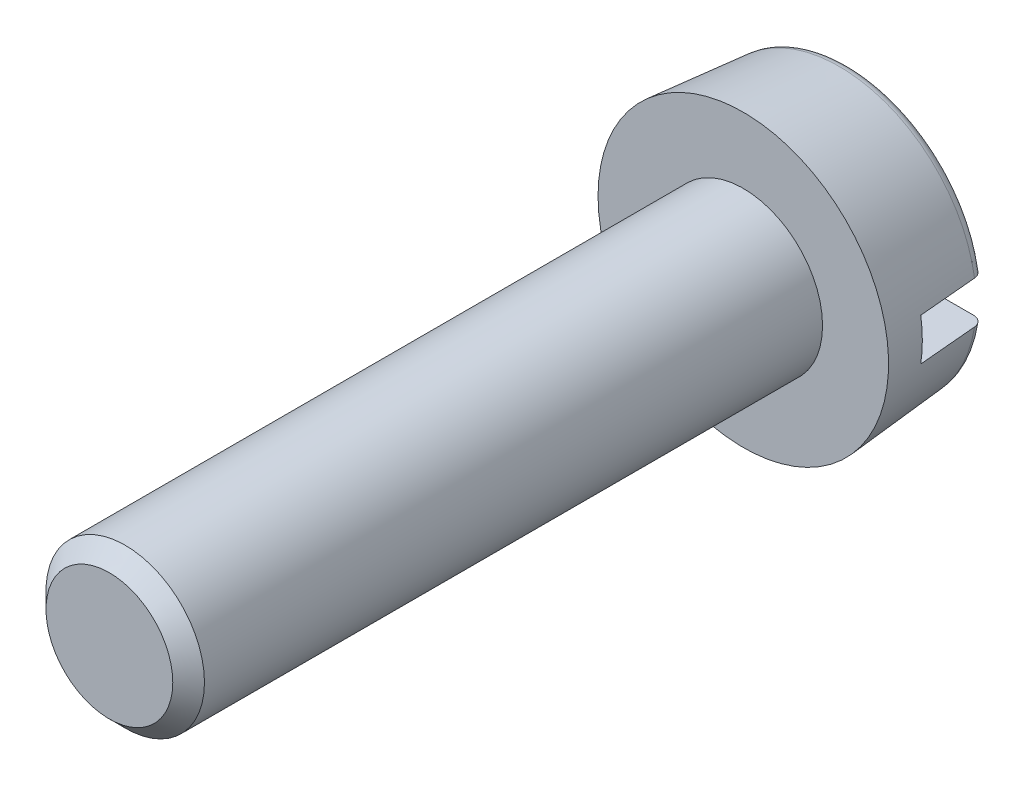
ISO-10303-21;
HEADER;
FILE_DESCRIPTION(('STEP AP214'),'2;1');
FILE_NAME('part.step','',(''),(''),'','','');
FILE_SCHEMA(('AUTOMOTIVE_DESIGN { 1 0 10303 214 1 1 1 1 }'));
ENDSEC;
DATA;
#1=APPLICATION_CONTEXT('core data for automotive mechanical design processes');
#2=APPLICATION_PROTOCOL_DEFINITION('international standard','automotive_design',2000,#1);
#3=PRODUCT_CONTEXT('',#1,'mechanical');
#4=PRODUCT('Part','Part','',(#3));
#5=PRODUCT_RELATED_PRODUCT_CATEGORY('part','',(#4));
#6=PRODUCT_DEFINITION_FORMATION('','',#4);
#7=PRODUCT_DEFINITION_CONTEXT('part definition',#1,'design');
#8=PRODUCT_DEFINITION('design','',#6,#7);
#9=PRODUCT_DEFINITION_SHAPE('','',#8);
#10=(LENGTH_UNIT() NAMED_UNIT(*) SI_UNIT(.MILLI.,.METRE.));
#11=(NAMED_UNIT(*) PLANE_ANGLE_UNIT() SI_UNIT($,.RADIAN.));
#12=(NAMED_UNIT(*) SI_UNIT($,.STERADIAN.) SOLID_ANGLE_UNIT());
#13=UNCERTAINTY_MEASURE_WITH_UNIT(LENGTH_MEASURE(1.E-05),#10,'distance_accuracy_value','');
#14=(GEOMETRIC_REPRESENTATION_CONTEXT(3) GLOBAL_UNCERTAINTY_ASSIGNED_CONTEXT((#13)) GLOBAL_UNIT_ASSIGNED_CONTEXT((#10,
#11,#12)) REPRESENTATION_CONTEXT('',''));
#15=CARTESIAN_POINT('',(0.,0.,0.));
#16=DIRECTION('',(0.,0.,1.));
#17=DIRECTION('',(1.,0.,0.));
#18=AXIS2_PLACEMENT_3D('',#15,#16,#17);
#19=CARTESIAN_POINT('',(0.,0.,-2.));
#20=DIRECTION('',(0.,0.,1.));
#21=DIRECTION('',(1.,0.,0.));
#22=AXIS2_PLACEMENT_3D('',#19,#20,#21);
#23=PLANE('',#22);
#24=DIRECTION('',(1.,0.,0.));
#25=VECTOR('',#24,1.);
#26=CARTESIAN_POINT('',(-2.75,-0.4,-2.));
#27=LINE('',#26,#25);
#28=CARTESIAN_POINT('',(-2.35807100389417,-0.4,-2.));
#29=VERTEX_POINT('',#28);
#30=CARTESIAN_POINT('',(2.35807100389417,-0.4,-2.));
#31=VERTEX_POINT('',#30);
#32=EDGE_CURVE('E196',#29,#31,#27,.T.);
#33=ORIENTED_EDGE('',*,*,#32,.T.);
#34=CARTESIAN_POINT('',(0.,0.,-2.));
#35=DIRECTION('',(0.,0.,-1.));
#36=DIRECTION('',(-1.,0.,0.));
#37=AXIS2_PLACEMENT_3D('',#34,#35,#36);
#38=CIRCLE('',#37,2.39175643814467);
#39=EDGE_CURVE('E106',#31,#29,#38,.T.);
#40=ORIENTED_EDGE('',*,*,#39,.T.);
#41=EDGE_LOOP('',(#33,#40));
#42=FACE_BOUND('',#41,.T.);
#43=ADVANCED_FACE('F26',(#42),#23,.F.);
#44=DIRECTION('',(-1.,0.,0.));
#45=VECTOR('',#44,1.);
#46=CARTESIAN_POINT('',(-2.75,0.4,-2.));
#47=LINE('',#46,#45);
#48=CARTESIAN_POINT('',(2.35807100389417,0.4,-2.));
#49=VERTEX_POINT('',#48);
#50=CARTESIAN_POINT('',(-2.35807100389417,0.4,-2.));
#51=VERTEX_POINT('',#50);
#52=EDGE_CURVE('E91',#49,#51,#47,.T.);
#53=ORIENTED_EDGE('',*,*,#52,.T.);
#54=EDGE_CURVE('E103',#51,#49,#38,.T.);
#55=ORIENTED_EDGE('',*,*,#54,.T.);
#56=EDGE_LOOP('',(#53,#55));
#57=FACE_BOUND('',#56,.T.);
#58=ADVANCED_FACE('F137',(#57),#23,.F.);
#59=CARTESIAN_POINT('',(0.,0.,-1.8));
#60=DIRECTION('',(0.,0.,-1.));
#61=DIRECTION('',(-1.,0.,0.));
#62=AXIS2_PLACEMENT_3D('',#59,#60,#61);
#63=TOROIDAL_SURFACE('',#62,2.39175643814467,0.2);
#64=CARTESIAN_POINT('',(-2.46056004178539,-0.4,-1.6274373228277));
#65=CARTESIAN_POINT('',(-2.47035713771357,-0.4,-1.63309189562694));
#66=CARTESIAN_POINT('',(-2.47967120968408,-0.4,-1.63958058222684));
#67=CARTESIAN_POINT('',(-2.49708617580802,-0.4,-1.65401697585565));
#68=CARTESIAN_POINT('',(-2.50518738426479,-0.4,-1.66196430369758));
#69=CARTESIAN_POINT('',(-2.51994054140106,-0.4,-1.67911855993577));
#70=CARTESIAN_POINT('',(-2.5265913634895,-0.4,-1.68832645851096));
#71=CARTESIAN_POINT('',(-2.53823475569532,-0.4,-1.70773274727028));
#72=CARTESIAN_POINT('',(-2.5432279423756,-0.4,-1.71793076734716));
#73=CARTESIAN_POINT('',(-2.55137056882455,-0.4,-1.73893734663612));
#74=CARTESIAN_POINT('',(-2.55453548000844,-0.4,-1.7497399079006));
#75=CARTESIAN_POINT('',(-2.55899152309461,-0.4,-1.77172702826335));
#76=CARTESIAN_POINT('',(-2.56028235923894,-0.4,-1.78291164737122));
#77=CARTESIAN_POINT('',(-2.56094692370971,-0.4,-1.80525009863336));
#78=CARTESIAN_POINT('',(-2.56033550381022,-0.4,-1.8164034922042));
#79=CARTESIAN_POINT('',(-2.55724668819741,-0.4,-1.83844701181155));
#80=CARTESIAN_POINT('',(-2.55476962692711,-0.4,-1.84933718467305));
#81=CARTESIAN_POINT('',(-2.54811803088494,-0.4,-1.87025531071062));
#82=CARTESIAN_POINT('',(-2.54399201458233,-0.4,-1.88029873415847));
#83=CARTESIAN_POINT('',(-2.53416340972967,-0.4,-1.89958227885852));
#84=CARTESIAN_POINT('',(-2.52846069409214,-0.4,-1.90882233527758));
#85=CARTESIAN_POINT('',(-2.51532195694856,-0.4,-1.92668639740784));
#86=CARTESIAN_POINT('',(-2.50781480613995,-0.4,-1.93525817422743));
#87=CARTESIAN_POINT('',(-2.49146359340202,-0.4,-1.9510149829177));
#88=CARTESIAN_POINT('',(-2.4826193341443,-0.4,-1.95819980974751));
#89=CARTESIAN_POINT('',(-2.46385856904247,-0.4,-1.9709840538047));
#90=CARTESIAN_POINT('',(-2.4539426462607,-0.4,-1.9765843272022));
#91=CARTESIAN_POINT('',(-2.43331831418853,-0.4,-1.98605791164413));
#92=CARTESIAN_POINT('',(-2.42260990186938,-0.4,-1.98993121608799));
#93=CARTESIAN_POINT('',(-2.40060009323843,-0.4,-1.99587983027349));
#94=CARTESIAN_POINT('',(-2.38929418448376,-0.4,-1.99793844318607));
#95=CARTESIAN_POINT('',(-2.36649726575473,-0.4,-2.00014639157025));
#96=CARTESIAN_POINT('',(-2.35500624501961,-0.4,-2.00029561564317));
#97=CARTESIAN_POINT('',(-2.33205956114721,-0.4,-1.99867602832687));
#98=CARTESIAN_POINT('',(-2.32060506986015,-0.4,-1.99689056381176));
#99=CARTESIAN_POINT('',(-2.298157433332,-0.4,-1.99142360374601));
#100=CARTESIAN_POINT('',(-2.28716429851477,-0.4,-1.98774206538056));
#101=CARTESIAN_POINT('',(-2.26594729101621,-0.4,-1.97857791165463));
#102=CARTESIAN_POINT('',(-2.25572391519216,-0.4,-1.97309414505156));
#103=CARTESIAN_POINT('',(-2.23635374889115,-0.4,-1.96047345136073));
#104=CARTESIAN_POINT('',(-2.22720691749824,-0.4,-1.95333658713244));
#105=CARTESIAN_POINT('',(-2.21034118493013,-0.4,-1.93767625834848));
#106=CARTESIAN_POINT('',(-2.20261024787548,-0.4,-1.92916576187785));
#107=CARTESIAN_POINT('',(-2.18871351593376,-0.4,-1.91095027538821));
#108=CARTESIAN_POINT('',(-2.18254759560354,-0.4,-1.90124538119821));
#109=CARTESIAN_POINT('',(-2.17205702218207,-0.4,-1.88107521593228));
#110=CARTESIAN_POINT('',(-2.16770567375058,-0.4,-1.8706238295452));
#111=CARTESIAN_POINT('',(-2.16084806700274,-0.4,-1.84913260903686));
#112=CARTESIAN_POINT('',(-2.15834160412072,-0.4,-1.83809284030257));
#113=CARTESIAN_POINT('',(-2.15527626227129,-0.4,-1.81590555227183));
#114=CARTESIAN_POINT('',(-2.15469036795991,-0.4,-1.80476175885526));
#115=CARTESIAN_POINT('',(-2.15540871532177,-0.4,-1.78253485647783));
#116=CARTESIAN_POINT('',(-2.1567129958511,-0.4,-1.77145174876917));
#117=CARTESIAN_POINT('',(-2.16115872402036,-0.4,-1.74972083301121));
#118=CARTESIAN_POINT('',(-2.16429062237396,-0.4,-1.73907106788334));
#119=CARTESIAN_POINT('',(-2.17228616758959,-0.4,-1.71844530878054));
#120=CARTESIAN_POINT('',(-2.17714955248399,-0.4,-1.70846921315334));
#121=CARTESIAN_POINT('',(-2.18849754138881,-0.4,-1.68940045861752));
#122=CARTESIAN_POINT('',(-2.19499228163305,-0.4,-1.6803138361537));
#123=CARTESIAN_POINT('',(-2.20939691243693,-0.4,-1.66333658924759));
#124=CARTESIAN_POINT('',(-2.21730736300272,-0.4,-1.65544644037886));
#125=CARTESIAN_POINT('',(-2.23443758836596,-0.4,-1.64097145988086));
#126=CARTESIAN_POINT('',(-2.24367438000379,-0.4,-1.6344067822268));
#127=CARTESIAN_POINT('',(-2.26310409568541,-0.4,-1.62288608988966));
#128=CARTESIAN_POINT('',(-2.27329719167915,-0.4,-1.61793036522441));
#129=CARTESIAN_POINT('',(-2.28383355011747,-0.4,-1.61386077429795));
#130=B_SPLINE_CURVE_WITH_KNOTS('',3,(#64,#65,#66,#67,#68,#69,#70,#71,#72,#73,#74,#75,#76,#77,
#78,#79,#80,#81,#82,#83,#84,#85,#86,#87,#88,#89,#90,#91,#92,#93,#94,#95,#96,#97,#98,#99,#100,
#101,#102,#103,#104,#105,#106,#107,#108,#109,#110,#111,#112,#113,#114,#115,#116,#117,#118,#119,
#120,#121,#122,#123,#124,#125,#126,#127,#128,#129),.UNSPECIFIED.,.F.,.F.,(4,2,2,2,2,2,2,2,2,2,2,
2,2,2,2,2,2,2,2,2,2,2,2,2,2,2,2,2,2,2,2,2,4),(0.,0.033894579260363,0.067780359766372,
0.101692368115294,0.135591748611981,0.16919989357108,0.202813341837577,0.236165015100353,
0.269510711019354,0.301940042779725,0.334371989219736,0.368390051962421,0.402413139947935,
0.436417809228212,0.470422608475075,0.504737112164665,0.539053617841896,0.573667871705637,
0.60828290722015,0.642920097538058,0.677555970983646,0.711882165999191,0.746205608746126,
0.780004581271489,0.813799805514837,0.847117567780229,0.880436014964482,0.913581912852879,
0.946722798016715,0.98007492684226,1.01344027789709,1.04728001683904,1.08112585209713),.UNSPECIFIED.);
#131=CARTESIAN_POINT('',(-2.55993301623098,-0.4,-1.81743114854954));
#132=VERTEX_POINT('',#131);
#133=EDGE_CURVE('E48',#29,#132,#130,.F.);
#134=ORIENTED_EDGE('',*,*,#133,.F.);
#135=ORIENTED_EDGE('',*,*,#39,.F.);
#136=CARTESIAN_POINT('',(2.26463348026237,-0.4,-1.62245170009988));
#137=CARTESIAN_POINT('',(2.25450054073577,-0.4,-1.62761569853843));
#138=CARTESIAN_POINT('',(2.24480752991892,-0.4,-1.63364077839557));
#139=CARTESIAN_POINT('',(2.22655983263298,-0.4,-1.64721950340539));
#140=CARTESIAN_POINT('',(2.21800507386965,-0.4,-1.65477305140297));
#141=CARTESIAN_POINT('',(2.20228447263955,-0.4,-1.67122264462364));
#142=CARTESIAN_POINT('',(2.1951197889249,-0.4,-1.68011979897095));
#143=CARTESIAN_POINT('',(2.18240904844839,-0.4,-1.69899889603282));
#144=CARTESIAN_POINT('',(2.17686229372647,-0.4,-1.70898036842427));
#145=CARTESIAN_POINT('',(2.16761264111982,-0.4,-1.7296271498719));
#146=CARTESIAN_POINT('',(2.16388939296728,-0.4,-1.74028333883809));
#147=CARTESIAN_POINT('',(2.15831063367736,-0.4,-1.76207632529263));
#148=CARTESIAN_POINT('',(2.15645538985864,-0.4,-1.77321319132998));
#149=CARTESIAN_POINT('',(2.15468535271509,-0.4,-1.79549349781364));
#150=CARTESIAN_POINT('',(2.15474560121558,-0.4,-1.80663496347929));
#151=CARTESIAN_POINT('',(2.15674287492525,-0.4,-1.82874600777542));
#152=CARTESIAN_POINT('',(2.15867941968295,-0.4,-1.83971562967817));
#153=CARTESIAN_POINT('',(2.16422713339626,-0.4,-1.86064578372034));
#154=CARTESIAN_POINT('',(2.16775159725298,-0.4,-1.87062942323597));
#155=CARTESIAN_POINT('',(2.17634210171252,-0.4,-1.88991007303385));
#156=CARTESIAN_POINT('',(2.18140828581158,-0.4,-1.89920701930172));
#157=CARTESIAN_POINT('',(2.19339026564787,-0.4,-1.917566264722));
#158=CARTESIAN_POINT('',(2.20041839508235,-0.4,-1.92655545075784));
#159=CARTESIAN_POINT('',(2.21588967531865,-0.4,-1.94322154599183));
#160=CARTESIAN_POINT('',(2.2243331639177,-0.4,-1.95089814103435));
#161=CARTESIAN_POINT('',(2.24237838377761,-0.4,-1.96472641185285));
#162=CARTESIAN_POINT('',(2.25197933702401,-0.4,-1.97087910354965));
#163=CARTESIAN_POINT('',(2.27206860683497,-0.4,-1.98150489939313));
#164=CARTESIAN_POINT('',(2.28255691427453,-0.4,-1.98597802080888));
#165=CARTESIAN_POINT('',(2.30424234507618,-0.4,-1.99316733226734));
#166=CARTESIAN_POINT('',(2.31544577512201,-0.4,-1.99586450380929));
#167=CARTESIAN_POINT('',(2.33814570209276,-0.4,-1.99935479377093));
#168=CARTESIAN_POINT('',(2.34964221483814,-0.4,-2.00014780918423));
#169=CARTESIAN_POINT('',(2.37268954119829,-0.4,-1.99980564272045));
#170=CARTESIAN_POINT('',(2.38424015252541,-0.4,-1.99865658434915));
#171=CARTESIAN_POINT('',(2.40698369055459,-0.4,-1.99443117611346));
#172=CARTESIAN_POINT('',(2.41817661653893,-0.4,-1.99135482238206));
#173=CARTESIAN_POINT('',(2.43985624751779,-0.4,-1.98336386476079));
#174=CARTESIAN_POINT('',(2.4503445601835,-0.4,-1.97845362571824));
#175=CARTESIAN_POINT('',(2.47033664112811,-0.4,-1.96692517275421));
#176=CARTESIAN_POINT('',(2.47984045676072,-0.4,-1.96030704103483));
#177=CARTESIAN_POINT('',(2.49749194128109,-0.4,-1.94561808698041));
#178=CARTESIAN_POINT('',(2.50565202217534,-0.4,-1.93756218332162));
#179=CARTESIAN_POINT('',(2.5204828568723,-0.4,-1.92017934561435));
#180=CARTESIAN_POINT('',(2.52715370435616,-0.4,-1.91085249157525));
#181=CARTESIAN_POINT('',(2.53872804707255,-0.4,-1.89131867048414));
#182=CARTESIAN_POINT('',(2.54365271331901,-0.4,-1.88112424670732));
#183=CARTESIAN_POINT('',(2.5517001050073,-0.4,-1.8600476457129));
#184=CARTESIAN_POINT('',(2.55482298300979,-0.4,-1.8491655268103));
#185=CARTESIAN_POINT('',(2.55914820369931,-0.4,-1.82714318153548));
#186=CARTESIAN_POINT('',(2.5603700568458,-0.4,-1.81600678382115));
#187=CARTESIAN_POINT('',(2.56091765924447,-0.4,-1.79368689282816));
#188=CARTESIAN_POINT('',(2.56024334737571,-0.4,-1.78250339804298));
#189=CARTESIAN_POINT('',(2.55702614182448,-0.4,-1.76045880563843));
#190=CARTESIAN_POINT('',(2.5544914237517,-0.4,-1.74959651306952));
#191=CARTESIAN_POINT('',(2.54763978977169,-0.4,-1.72845177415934));
#192=CARTESIAN_POINT('',(2.54332318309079,-0.4,-1.71816922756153));
#193=CARTESIAN_POINT('',(2.53302184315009,-0.4,-1.69844096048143));
#194=CARTESIAN_POINT('',(2.52703252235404,-0.4,-1.68899763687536));
#195=CARTESIAN_POINT('',(2.51356522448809,-0.4,-1.67123531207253));
#196=CARTESIAN_POINT('',(2.50608671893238,-0.4,-1.6629167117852));
#197=CARTESIAN_POINT('',(2.48978467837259,-0.4,-1.6475652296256));
#198=CARTESIAN_POINT('',(2.48094983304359,-0.4,-1.64054436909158));
#199=CARTESIAN_POINT('',(2.46224022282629,-0.4,-1.62805472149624));
#200=CARTESIAN_POINT('',(2.45236515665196,-0.4,-1.62258638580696));
#201=CARTESIAN_POINT('',(2.44210063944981,-0.4,-1.61798379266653));
#202=B_SPLINE_CURVE_WITH_KNOTS('',3,(#136,#137,#138,#139,#140,#141,#142,#143,#144,#145,#146,
#147,#148,#149,#150,#151,#152,#153,#154,#155,#156,#157,#158,#159,#160,#161,#162,#163,#164,#165,
#166,#167,#168,#169,#170,#171,#172,#173,#174,#175,#176,#177,#178,#179,#180,#181,#182,#183,#184,
#185,#186,#187,#188,#189,#190,#191,#192,#193,#194,#195,#196,#197,#198,#199,#200,#201),
.UNSPECIFIED.,.F.,.F.,(4,2,2,2,2,2,2,2,2,2,2,2,2,2,2,2,2,2,2,2,2,2,2,2,2,2,2,2,2,2,2,2,4),(0.,
0.0340784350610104,0.0681547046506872,0.102259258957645,0.136349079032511,0.170049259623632,
0.203754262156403,0.23702028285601,0.270277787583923,0.301905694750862,0.33353654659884,
0.367601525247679,0.401674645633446,0.435724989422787,0.469774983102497,0.504183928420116,
0.538594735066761,0.573252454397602,0.607910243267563,0.642486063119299,0.677060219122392,
0.711294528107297,0.745526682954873,0.779328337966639,0.813127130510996,0.846576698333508,
0.880027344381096,0.91333186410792,0.946630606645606,0.980021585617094,1.01342443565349,
1.04712269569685,1.08083074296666),.UNSPECIFIED.);
#203=CARTESIAN_POINT('',(2.55993301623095,-0.4,-1.81743114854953));
#204=VERTEX_POINT('',#203);
#205=EDGE_CURVE('E124',#204,#31,#202,.F.);
#206=ORIENTED_EDGE('',*,*,#205,.F.);
#207=CARTESIAN_POINT('',(0.,0.,-1.81743114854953));
#208=DIRECTION('',(0.,0.,-1.));
#209=DIRECTION('',(-1.,0.,0.));
#210=AXIS2_PLACEMENT_3D('',#207,#208,#209);
#211=CIRCLE('',#210,2.59099537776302);
#212=EDGE_CURVE('E115',#204,#132,#211,.T.);
#213=ORIENTED_EDGE('',*,*,#212,.T.);
#214=EDGE_LOOP('',(#134,#135,#206,#213));
#215=FACE_BOUND('',#214,.T.);
#216=ADVANCED_FACE('F132',(#215),#63,.T.);
#217=CARTESIAN_POINT('',(-2.46056004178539,0.4,-1.6274373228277));
#218=CARTESIAN_POINT('',(-2.47035713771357,0.4,-1.63309189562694));
#219=CARTESIAN_POINT('',(-2.47967120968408,0.4,-1.63958058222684));
#220=CARTESIAN_POINT('',(-2.49708617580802,0.4,-1.65401697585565));
#221=CARTESIAN_POINT('',(-2.50518738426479,0.4,-1.66196430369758));
#222=CARTESIAN_POINT('',(-2.51994054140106,0.4,-1.67911855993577));
#223=CARTESIAN_POINT('',(-2.5265913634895,0.4,-1.68832645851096));
#224=CARTESIAN_POINT('',(-2.53823475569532,0.4,-1.70773274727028));
#225=CARTESIAN_POINT('',(-2.5432279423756,0.4,-1.71793076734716));
#226=CARTESIAN_POINT('',(-2.55137056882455,0.4,-1.73893734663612));
#227=CARTESIAN_POINT('',(-2.55453548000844,0.4,-1.7497399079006));
#228=CARTESIAN_POINT('',(-2.55899152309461,0.4,-1.77172702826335));
#229=CARTESIAN_POINT('',(-2.56028235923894,0.4,-1.78291164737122));
#230=CARTESIAN_POINT('',(-2.56094692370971,0.4,-1.80525009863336));
#231=CARTESIAN_POINT('',(-2.56033550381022,0.4,-1.8164034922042));
#232=CARTESIAN_POINT('',(-2.55724668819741,0.4,-1.83844701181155));
#233=CARTESIAN_POINT('',(-2.55476962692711,0.4,-1.84933718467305));
#234=CARTESIAN_POINT('',(-2.54811803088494,0.4,-1.87025531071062));
#235=CARTESIAN_POINT('',(-2.54399201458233,0.4,-1.88029873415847));
#236=CARTESIAN_POINT('',(-2.53416340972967,0.4,-1.89958227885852));
#237=CARTESIAN_POINT('',(-2.52846069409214,0.4,-1.90882233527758));
#238=CARTESIAN_POINT('',(-2.51532195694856,0.4,-1.92668639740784));
#239=CARTESIAN_POINT('',(-2.50781480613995,0.4,-1.93525817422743));
#240=CARTESIAN_POINT('',(-2.49146359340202,0.4,-1.9510149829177));
#241=CARTESIAN_POINT('',(-2.4826193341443,0.4,-1.95819980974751));
#242=CARTESIAN_POINT('',(-2.46385856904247,0.4,-1.9709840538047));
#243=CARTESIAN_POINT('',(-2.4539426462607,0.4,-1.9765843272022));
#244=CARTESIAN_POINT('',(-2.43331831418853,0.4,-1.98605791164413));
#245=CARTESIAN_POINT('',(-2.42260990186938,0.4,-1.98993121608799));
#246=CARTESIAN_POINT('',(-2.40060009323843,0.4,-1.99587983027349));
#247=CARTESIAN_POINT('',(-2.38929418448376,0.4,-1.99793844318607));
#248=CARTESIAN_POINT('',(-2.36649726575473,0.4,-2.00014639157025));
#249=CARTESIAN_POINT('',(-2.35500624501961,0.4,-2.00029561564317));
#250=CARTESIAN_POINT('',(-2.33205956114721,0.4,-1.99867602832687));
#251=CARTESIAN_POINT('',(-2.32060506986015,0.4,-1.99689056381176));
#252=CARTESIAN_POINT('',(-2.298157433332,0.4,-1.99142360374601));
#253=CARTESIAN_POINT('',(-2.28716429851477,0.4,-1.98774206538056));
#254=CARTESIAN_POINT('',(-2.26594729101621,0.4,-1.97857791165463));
#255=CARTESIAN_POINT('',(-2.25572391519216,0.4,-1.97309414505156));
#256=CARTESIAN_POINT('',(-2.23635374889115,0.4,-1.96047345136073));
#257=CARTESIAN_POINT('',(-2.22720691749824,0.4,-1.95333658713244));
#258=CARTESIAN_POINT('',(-2.21034118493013,0.4,-1.93767625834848));
#259=CARTESIAN_POINT('',(-2.20261024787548,0.4,-1.92916576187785));
#260=CARTESIAN_POINT('',(-2.18871351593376,0.4,-1.91095027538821));
#261=CARTESIAN_POINT('',(-2.18254759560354,0.4,-1.90124538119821));
#262=CARTESIAN_POINT('',(-2.17205702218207,0.4,-1.88107521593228));
#263=CARTESIAN_POINT('',(-2.16770567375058,0.4,-1.8706238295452));
#264=CARTESIAN_POINT('',(-2.16084806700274,0.4,-1.84913260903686));
#265=CARTESIAN_POINT('',(-2.15834160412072,0.4,-1.83809284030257));
#266=CARTESIAN_POINT('',(-2.15527626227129,0.4,-1.81590555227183));
#267=CARTESIAN_POINT('',(-2.15469036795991,0.4,-1.80476175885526));
#268=CARTESIAN_POINT('',(-2.15540871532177,0.4,-1.78253485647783));
#269=CARTESIAN_POINT('',(-2.1567129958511,0.4,-1.77145174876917));
#270=CARTESIAN_POINT('',(-2.16115872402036,0.4,-1.74972083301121));
#271=CARTESIAN_POINT('',(-2.16429062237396,0.4,-1.73907106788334));
#272=CARTESIAN_POINT('',(-2.17228616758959,0.4,-1.71844530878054));
#273=CARTESIAN_POINT('',(-2.17714955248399,0.4,-1.70846921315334));
#274=CARTESIAN_POINT('',(-2.18849754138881,0.4,-1.68940045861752));
#275=CARTESIAN_POINT('',(-2.19499228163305,0.4,-1.6803138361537));
#276=CARTESIAN_POINT('',(-2.20939691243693,0.4,-1.66333658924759));
#277=CARTESIAN_POINT('',(-2.21730736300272,0.4,-1.65544644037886));
#278=CARTESIAN_POINT('',(-2.23443758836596,0.4,-1.64097145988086));
#279=CARTESIAN_POINT('',(-2.24367438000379,0.4,-1.6344067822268));
#280=CARTESIAN_POINT('',(-2.26310409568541,0.4,-1.62288608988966));
#281=CARTESIAN_POINT('',(-2.27329719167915,0.4,-1.61793036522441));
#282=CARTESIAN_POINT('',(-2.28383355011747,0.4,-1.61386077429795));
#283=B_SPLINE_CURVE_WITH_KNOTS('',3,(#217,#218,#219,#220,#221,#222,#223,#224,#225,#226,#227,
#228,#229,#230,#231,#232,#233,#234,#235,#236,#237,#238,#239,#240,#241,#242,#243,#244,#245,#246,
#247,#248,#249,#250,#251,#252,#253,#254,#255,#256,#257,#258,#259,#260,#261,#262,#263,#264,#265,
#266,#267,#268,#269,#270,#271,#272,#273,#274,#275,#276,#277,#278,#279,#280,#281,#282),
.UNSPECIFIED.,.F.,.F.,(4,2,2,2,2,2,2,2,2,2,2,2,2,2,2,2,2,2,2,2,2,2,2,2,2,2,2,2,2,2,2,2,4),(0.,
0.033894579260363,0.067780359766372,0.101692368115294,0.135591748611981,0.16919989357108,
0.202813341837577,0.236165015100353,0.269510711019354,0.301940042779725,0.334371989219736,
0.368390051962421,0.402413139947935,0.436417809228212,0.470422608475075,0.504737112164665,
0.539053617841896,0.573667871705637,0.60828290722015,0.642920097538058,0.677555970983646,
0.711882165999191,0.746205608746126,0.78000458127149,0.813799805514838,0.847117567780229,
0.880436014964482,0.913581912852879,0.946722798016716,0.98007492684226,1.01344027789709,
1.04728001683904,1.08112585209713),.UNSPECIFIED.);
#284=CARTESIAN_POINT('',(-2.55993301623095,0.4,-1.81743114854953));
#285=VERTEX_POINT('',#284);
#286=EDGE_CURVE('E149',#285,#51,#283,.T.);
#287=ORIENTED_EDGE('',*,*,#286,.F.);
#288=CARTESIAN_POINT('',(2.55993301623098,0.4,-1.81743114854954));
#289=VERTEX_POINT('',#288);
#290=EDGE_CURVE('E111',#285,#289,#211,.T.);
#291=ORIENTED_EDGE('',*,*,#290,.T.);
#292=CARTESIAN_POINT('',(2.26463348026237,0.4,-1.62245170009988));
#293=CARTESIAN_POINT('',(2.25450054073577,0.4,-1.62761569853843));
#294=CARTESIAN_POINT('',(2.24480752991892,0.4,-1.63364077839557));
#295=CARTESIAN_POINT('',(2.22655983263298,0.4,-1.64721950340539));
#296=CARTESIAN_POINT('',(2.21800507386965,0.4,-1.65477305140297));
#297=CARTESIAN_POINT('',(2.20228447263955,0.4,-1.67122264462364));
#298=CARTESIAN_POINT('',(2.1951197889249,0.4,-1.68011979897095));
#299=CARTESIAN_POINT('',(2.18240904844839,0.4,-1.69899889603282));
#300=CARTESIAN_POINT('',(2.17686229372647,0.4,-1.70898036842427));
#301=CARTESIAN_POINT('',(2.16761264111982,0.4,-1.7296271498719));
#302=CARTESIAN_POINT('',(2.16388939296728,0.4,-1.74028333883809));
#303=CARTESIAN_POINT('',(2.15831063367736,0.4,-1.76207632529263));
#304=CARTESIAN_POINT('',(2.15645538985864,0.4,-1.77321319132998));
#305=CARTESIAN_POINT('',(2.15468535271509,0.4,-1.79549349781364));
#306=CARTESIAN_POINT('',(2.15474560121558,0.4,-1.80663496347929));
#307=CARTESIAN_POINT('',(2.15674287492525,0.4,-1.82874600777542));
#308=CARTESIAN_POINT('',(2.15867941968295,0.4,-1.83971562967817));
#309=CARTESIAN_POINT('',(2.16422713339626,0.4,-1.86064578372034));
#310=CARTESIAN_POINT('',(2.16775159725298,0.4,-1.87062942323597));
#311=CARTESIAN_POINT('',(2.17634210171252,0.4,-1.88991007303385));
#312=CARTESIAN_POINT('',(2.18140828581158,0.4,-1.89920701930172));
#313=CARTESIAN_POINT('',(2.19339026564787,0.4,-1.917566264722));
#314=CARTESIAN_POINT('',(2.20041839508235,0.4,-1.92655545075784));
#315=CARTESIAN_POINT('',(2.21588967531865,0.4,-1.94322154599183));
#316=CARTESIAN_POINT('',(2.2243331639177,0.4,-1.95089814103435));
#317=CARTESIAN_POINT('',(2.24237838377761,0.4,-1.96472641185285));
#318=CARTESIAN_POINT('',(2.25197933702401,0.4,-1.97087910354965));
#319=CARTESIAN_POINT('',(2.27206860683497,0.4,-1.98150489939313));
#320=CARTESIAN_POINT('',(2.28255691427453,0.4,-1.98597802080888));
#321=CARTESIAN_POINT('',(2.30424234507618,0.4,-1.99316733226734));
#322=CARTESIAN_POINT('',(2.31544577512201,0.4,-1.99586450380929));
#323=CARTESIAN_POINT('',(2.33814570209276,0.4,-1.99935479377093));
#324=CARTESIAN_POINT('',(2.34964221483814,0.4,-2.00014780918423));
#325=CARTESIAN_POINT('',(2.37268954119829,0.4,-1.99980564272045));
#326=CARTESIAN_POINT('',(2.38424015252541,0.4,-1.99865658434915));
#327=CARTESIAN_POINT('',(2.40698369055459,0.4,-1.99443117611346));
#328=CARTESIAN_POINT('',(2.41817661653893,0.4,-1.99135482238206));
#329=CARTESIAN_POINT('',(2.43985624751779,0.4,-1.98336386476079));
#330=CARTESIAN_POINT('',(2.4503445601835,0.4,-1.97845362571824));
#331=CARTESIAN_POINT('',(2.47033664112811,0.4,-1.96692517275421));
#332=CARTESIAN_POINT('',(2.47984045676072,0.4,-1.96030704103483));
#333=CARTESIAN_POINT('',(2.49749194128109,0.4,-1.94561808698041));
#334=CARTESIAN_POINT('',(2.50565202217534,0.4,-1.93756218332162));
#335=CARTESIAN_POINT('',(2.5204828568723,0.4,-1.92017934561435));
#336=CARTESIAN_POINT('',(2.52715370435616,0.4,-1.91085249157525));
#337=CARTESIAN_POINT('',(2.53872804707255,0.4,-1.89131867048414));
#338=CARTESIAN_POINT('',(2.54365271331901,0.4,-1.88112424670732));
#339=CARTESIAN_POINT('',(2.5517001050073,0.4,-1.8600476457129));
#340=CARTESIAN_POINT('',(2.55482298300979,0.4,-1.8491655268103));
#341=CARTESIAN_POINT('',(2.55914820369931,0.4,-1.82714318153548));
#342=CARTESIAN_POINT('',(2.5603700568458,0.4,-1.81600678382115));
#343=CARTESIAN_POINT('',(2.56091765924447,0.4,-1.79368689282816));
#344=CARTESIAN_POINT('',(2.56024334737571,0.4,-1.78250339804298));
#345=CARTESIAN_POINT('',(2.55702614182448,0.4,-1.76045880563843));
#346=CARTESIAN_POINT('',(2.5544914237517,0.4,-1.74959651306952));
#347=CARTESIAN_POINT('',(2.54763978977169,0.4,-1.72845177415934));
#348=CARTESIAN_POINT('',(2.54332318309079,0.4,-1.71816922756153));
#349=CARTESIAN_POINT('',(2.53302184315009,0.4,-1.69844096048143));
#350=CARTESIAN_POINT('',(2.52703252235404,0.4,-1.68899763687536));
#351=CARTESIAN_POINT('',(2.51356522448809,0.4,-1.67123531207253));
#352=CARTESIAN_POINT('',(2.50608671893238,0.4,-1.6629167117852));
#353=CARTESIAN_POINT('',(2.48978467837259,0.4,-1.6475652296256));
#354=CARTESIAN_POINT('',(2.48094983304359,0.4,-1.64054436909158));
#355=CARTESIAN_POINT('',(2.46224022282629,0.4,-1.62805472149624));
#356=CARTESIAN_POINT('',(2.45236515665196,0.4,-1.62258638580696));
#357=CARTESIAN_POINT('',(2.44210063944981,0.4,-1.61798379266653));
#358=B_SPLINE_CURVE_WITH_KNOTS('',3,(#292,#293,#294,#295,#296,#297,#298,#299,#300,#301,#302,
#303,#304,#305,#306,#307,#308,#309,#310,#311,#312,#313,#314,#315,#316,#317,#318,#319,#320,#321,
#322,#323,#324,#325,#326,#327,#328,#329,#330,#331,#332,#333,#334,#335,#336,#337,#338,#339,#340,
#341,#342,#343,#344,#345,#346,#347,#348,#349,#350,#351,#352,#353,#354,#355,#356,#357),
.UNSPECIFIED.,.F.,.F.,(4,2,2,2,2,2,2,2,2,2,2,2,2,2,2,2,2,2,2,2,2,2,2,2,2,2,2,2,2,2,2,2,4),(0.,
0.0340784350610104,0.0681547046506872,0.102259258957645,0.136349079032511,0.170049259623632,
0.203754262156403,0.23702028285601,0.270277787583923,0.301905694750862,0.33353654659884,
0.367601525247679,0.401674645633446,0.435724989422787,0.469774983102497,0.504183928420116,
0.538594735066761,0.573252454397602,0.607910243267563,0.642486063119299,0.677060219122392,
0.711294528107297,0.745526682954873,0.779328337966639,0.813127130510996,0.846576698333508,
0.880027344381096,0.91333186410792,0.946630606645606,0.980021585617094,1.01342443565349,
1.04712269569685,1.08083074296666),.UNSPECIFIED.);
#359=EDGE_CURVE('E143',#49,#289,#358,.T.);
#360=ORIENTED_EDGE('',*,*,#359,.F.);
#361=ORIENTED_EDGE('',*,*,#54,.F.);
#362=EDGE_LOOP('',(#287,#291,#360,#361));
#363=FACE_BOUND('',#362,.T.);
#364=ADVANCED_FACE('F136',(#363),#63,.T.);
#365=CARTESIAN_POINT('',(0.,0.,0.));
#366=DIRECTION('',(0.,0.,1.));
#367=DIRECTION('',(1.,0.,0.));
#368=AXIS2_PLACEMENT_3D('',#365,#366,#367);
#369=CONICAL_SURFACE('',#368,2.75,0.0872664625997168);
#370=CARTESIAN_POINT('',(0.,0.,0.));
#371=DIRECTION('',(0.,0.,-1.));
#372=DIRECTION('',(-1.,0.,0.));
#373=AXIS2_PLACEMENT_3D('',#370,#371,#372);
#374=CIRCLE('',#373,2.75);
#375=CARTESIAN_POINT('',(-2.75,0.,0.));
#376=VERTEX_POINT('',#375);
#377=EDGE_CURVE('E116',#376,#376,#374,.T.);
#378=ORIENTED_EDGE('',*,*,#377,.T.);
#379=EDGE_LOOP('',(#378));
#380=FACE_BOUND('',#379,.T.);
#381=CARTESIAN_POINT('',(-2.17665154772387,-0.4,-6.13679417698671));
#382=CARTESIAN_POINT('',(-2.29688458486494,-0.4,-4.78501127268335));
#383=CARTESIAN_POINT('',(-2.41682603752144,-0.4,-3.43320249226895));
#384=CARTESIAN_POINT('',(-2.55941857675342,-0.4,-1.82327092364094));
#385=CARTESIAN_POINT('',(-2.5822713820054,-0.4,-1.56516600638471));
#386=CARTESIAN_POINT('',(-2.74761802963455,-0.4,0.302879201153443));
#387=CARTESIAN_POINT('',(-2.88984427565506,-0.4,1.91284318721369));
#388=CARTESIAN_POINT('',(-3.03193476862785,-0.4,3.52281911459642));
#389=B_SPLINE_CURVE_WITH_KNOTS('',3,(#381,#382,#383,#384,#385,#386,#387,#388),.UNSPECIFIED.,.F.,
.F.,(4,2,2,4),(0.,4.07135801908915,4.84870195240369,9.69740384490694),.UNSPECIFIED.);
#390=CARTESIAN_POINT('',(-2.65883794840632,-0.4,-0.7));
#391=VERTEX_POINT('',#390);
#392=EDGE_CURVE('E76',#132,#391,#389,.T.);
#393=ORIENTED_EDGE('',*,*,#392,.F.);
#394=ORIENTED_EDGE('',*,*,#212,.F.);
#395=CARTESIAN_POINT('',(3.03193476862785,-0.4,3.52281911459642));
#396=CARTESIAN_POINT('',(2.96089605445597,-0.4,2.71783055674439));
#397=CARTESIAN_POINT('',(2.88981709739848,-0.4,1.9128455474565));
#398=CARTESIAN_POINT('',(2.74755308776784,-0.4,0.302884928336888));
#399=CARTESIAN_POINT('',(2.6763680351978,-0.4,-0.502090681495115));
#400=CARTESIAN_POINT('',(2.53386621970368,-0.4,-2.11203025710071));
#401=CARTESIAN_POINT('',(2.46254945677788,-0.4,-2.91699422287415));
#402=CARTESIAN_POINT('',(2.31974175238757,-0.4,-4.52690672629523));
#403=CARTESIAN_POINT('',(2.24825081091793,-0.4,-5.33185526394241));
#404=CARTESIAN_POINT('',(2.17665154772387,-0.4,-6.13679417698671));
#405=B_SPLINE_CURVE_WITH_KNOTS('',3,(#395,#396,#397,#398,#399,#400,#401,#402,#403,#404),
.UNSPECIFIED.,.F.,.F.,(4,2,2,2,4),(0.,2.42435098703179,4.84870190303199,7.27305285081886,
9.69740387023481),.UNSPECIFIED.);
#406=CARTESIAN_POINT('',(2.65883794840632,-0.4,-0.7));
#407=VERTEX_POINT('',#406);
#408=EDGE_CURVE('E96',#407,#204,#405,.T.);
#409=ORIENTED_EDGE('',*,*,#408,.F.);
#410=CARTESIAN_POINT('',(0.,0.,-0.7));
#411=DIRECTION('',(0.,0.,1.));
#412=DIRECTION('',(1.,0.,0.));
#413=AXIS2_PLACEMENT_3D('',#410,#411,#412);
#414=CIRCLE('',#413,2.68875793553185);
#415=CARTESIAN_POINT('',(2.65883794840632,0.4,-0.7));
#416=VERTEX_POINT('',#415);
#417=EDGE_CURVE('E90',#407,#416,#414,.T.);
#418=ORIENTED_EDGE('',*,*,#417,.T.);
#419=CARTESIAN_POINT('',(2.17665154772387,0.4,-6.13679417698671));
#420=CARTESIAN_POINT('',(2.29688458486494,0.4,-4.78501127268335));
#421=CARTESIAN_POINT('',(2.41682603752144,0.4,-3.43320249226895));
#422=CARTESIAN_POINT('',(2.55941857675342,0.4,-1.82327092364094));
#423=CARTESIAN_POINT('',(2.5822713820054,0.4,-1.56516600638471));
#424=CARTESIAN_POINT('',(2.74761802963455,0.4,0.302879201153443));
#425=CARTESIAN_POINT('',(2.88984427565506,0.4,1.91284318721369));
#426=CARTESIAN_POINT('',(3.03193476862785,0.4,3.52281911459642));
#427=B_SPLINE_CURVE_WITH_KNOTS('',3,(#419,#420,#421,#422,#423,#424,#425,#426),.UNSPECIFIED.,.F.,
.F.,(4,2,2,4),(0.,4.07135801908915,4.84870195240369,9.69740384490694),.UNSPECIFIED.);
#428=EDGE_CURVE('E99',#289,#416,#427,.T.);
#429=ORIENTED_EDGE('',*,*,#428,.F.);
#430=ORIENTED_EDGE('',*,*,#290,.F.);
#431=CARTESIAN_POINT('',(-3.03193476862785,0.4,3.52281911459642));
#432=CARTESIAN_POINT('',(-2.96089605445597,0.4,2.71783055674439));
#433=CARTESIAN_POINT('',(-2.88981709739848,0.4,1.9128455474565));
#434=CARTESIAN_POINT('',(-2.74755308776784,0.4,0.302884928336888));
#435=CARTESIAN_POINT('',(-2.6763680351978,0.4,-0.502090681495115));
#436=CARTESIAN_POINT('',(-2.53386621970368,0.4,-2.11203025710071));
#437=CARTESIAN_POINT('',(-2.46254945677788,0.4,-2.91699422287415));
#438=CARTESIAN_POINT('',(-2.31974175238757,0.4,-4.52690672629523));
#439=CARTESIAN_POINT('',(-2.24825081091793,0.4,-5.33185526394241));
#440=CARTESIAN_POINT('',(-2.17665154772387,0.4,-6.13679417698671));
#441=B_SPLINE_CURVE_WITH_KNOTS('',3,(#431,#432,#433,#434,#435,#436,#437,#438,#439,#440),
.UNSPECIFIED.,.F.,.F.,(4,2,2,2,4),(0.,2.42435098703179,4.84870190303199,7.27305285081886,
9.69740387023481),.UNSPECIFIED.);
#442=CARTESIAN_POINT('',(-2.65883794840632,0.4,-0.7));
#443=VERTEX_POINT('',#442);
#444=EDGE_CURVE('E85',#443,#285,#441,.T.);
#445=ORIENTED_EDGE('',*,*,#444,.F.);
#446=EDGE_CURVE('E88',#443,#391,#414,.T.);
#447=ORIENTED_EDGE('',*,*,#446,.T.);
#448=EDGE_LOOP('',(#393,#394,#409,#418,#429,#430,#445,#447));
#449=FACE_BOUND('',#448,.T.);
#450=ADVANCED_FACE('F94',(#380,#449),#369,.T.);
#451=CARTESIAN_POINT('',(0.,0.,0.));
#452=DIRECTION('',(0.,0.,-1.));
#453=DIRECTION('',(-1.,0.,0.));
#454=AXIS2_PLACEMENT_3D('',#451,#452,#453);
#455=PLANE('',#454);
#456=CARTESIAN_POINT('',(0.,0.,0.));
#457=DIRECTION('',(0.,0.,1.));
#458=DIRECTION('',(1.,0.,0.));
#459=AXIS2_PLACEMENT_3D('',#456,#457,#458);
#460=CIRCLE('',#459,1.5);
#461=CARTESIAN_POINT('',(1.5,0.,0.));
#462=VERTEX_POINT('',#461);
#463=EDGE_CURVE('E198',#462,#462,#460,.T.);
#464=ORIENTED_EDGE('',*,*,#463,.F.);
#465=EDGE_LOOP('',(#464));
#466=FACE_BOUND('',#465,.T.);
#467=ORIENTED_EDGE('',*,*,#377,.F.);
#468=EDGE_LOOP('',(#467));
#469=FACE_BOUND('',#468,.T.);
#470=ADVANCED_FACE('F211',(#466,#469),#455,.F.);
#471=CARTESIAN_POINT('',(-2.75,-0.4,-0.7));
#472=DIRECTION('',(0.,1.,0.));
#473=DIRECTION('',(0.,0.,1.));
#474=AXIS2_PLACEMENT_3D('',#471,#472,#473);
#475=PLANE('',#474);
#476=ORIENTED_EDGE('',*,*,#133,.T.);
#477=ORIENTED_EDGE('',*,*,#392,.T.);
#478=DIRECTION('',(1.,0.,0.));
#479=VECTOR('',#478,1.);
#480=CARTESIAN_POINT('',(-2.75,-0.4,-0.7));
#481=LINE('',#480,#479);
#482=EDGE_CURVE('E79',#391,#407,#481,.T.);
#483=ORIENTED_EDGE('',*,*,#482,.T.);
#484=ORIENTED_EDGE('',*,*,#408,.T.);
#485=ORIENTED_EDGE('',*,*,#205,.T.);
#486=ORIENTED_EDGE('',*,*,#32,.F.);
#487=EDGE_LOOP('',(#476,#477,#483,#484,#485,#486));
#488=FACE_BOUND('',#487,.T.);
#489=ADVANCED_FACE('F78',(#488),#475,.T.);
#490=CARTESIAN_POINT('',(-2.75,0.4,-0.7));
#491=DIRECTION('',(0.,-1.,0.));
#492=DIRECTION('',(0.,0.,-1.));
#493=AXIS2_PLACEMENT_3D('',#490,#491,#492);
#494=PLANE('',#493);
#495=ORIENTED_EDGE('',*,*,#286,.T.);
#496=ORIENTED_EDGE('',*,*,#52,.F.);
#497=ORIENTED_EDGE('',*,*,#359,.T.);
#498=ORIENTED_EDGE('',*,*,#428,.T.);
#499=DIRECTION('',(-1.,0.,0.));
#500=VECTOR('',#499,1.);
#501=CARTESIAN_POINT('',(-2.75,0.4,-0.7));
#502=LINE('',#501,#500);
#503=EDGE_CURVE('E40',#416,#443,#502,.T.);
#504=ORIENTED_EDGE('',*,*,#503,.T.);
#505=ORIENTED_EDGE('',*,*,#444,.T.);
#506=EDGE_LOOP('',(#495,#496,#497,#498,#504,#505));
#507=FACE_BOUND('',#506,.T.);
#508=ADVANCED_FACE('F153',(#507),#494,.T.);
#509=CARTESIAN_POINT('',(-2.75,-0.4,-0.7));
#510=DIRECTION('',(0.,0.,1.));
#511=DIRECTION('',(1.,0.,0.));
#512=AXIS2_PLACEMENT_3D('',#509,#510,#511);
#513=PLANE('',#512);
#514=ORIENTED_EDGE('',*,*,#503,.F.);
#515=ORIENTED_EDGE('',*,*,#417,.F.);
#516=ORIENTED_EDGE('',*,*,#482,.F.);
#517=ORIENTED_EDGE('',*,*,#446,.F.);
#518=EDGE_LOOP('',(#514,#515,#516,#517));
#519=FACE_BOUND('',#518,.T.);
#520=ADVANCED_FACE('F87',(#519),#513,.F.);
#521=CARTESIAN_POINT('',(0.,0.,12.));
#522=DIRECTION('',(0.,0.,1.));
#523=DIRECTION('',(1.,0.,0.));
#524=AXIS2_PLACEMENT_3D('',#521,#522,#523);
#525=PLANE('',#524);
#526=CARTESIAN_POINT('',(0.,0.,12.));
#527=DIRECTION('',(0.,0.,1.));
#528=DIRECTION('',(1.,0.,0.));
#529=AXIS2_PLACEMENT_3D('',#526,#527,#528);
#530=CIRCLE('',#529,1.19999999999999);
#531=CARTESIAN_POINT('',(1.2,0.,12.));
#532=VERTEX_POINT('',#531);
#533=EDGE_CURVE('E33',#532,#532,#530,.T.);
#534=ORIENTED_EDGE('',*,*,#533,.T.);
#535=EDGE_LOOP('',(#534));
#536=FACE_BOUND('',#535,.T.);
#537=ADVANCED_FACE('F177',(#536),#525,.T.);
#538=CARTESIAN_POINT('',(0.,0.,0.));
#539=DIRECTION('',(0.,0.,1.));
#540=DIRECTION('',(1.,0.,0.));
#541=AXIS2_PLACEMENT_3D('',#538,#539,#540);
#542=CYLINDRICAL_SURFACE('',#541,1.5);
#543=CARTESIAN_POINT('',(0.,0.,11.7));
#544=DIRECTION('',(0.,0.,1.));
#545=DIRECTION('',(1.,0.,0.));
#546=AXIS2_PLACEMENT_3D('',#543,#544,#545);
#547=CIRCLE('',#546,1.5);
#548=CARTESIAN_POINT('',(1.5,0.,11.7));
#549=VERTEX_POINT('',#548);
#550=EDGE_CURVE('E11',#549,#549,#547,.F.);
#551=ORIENTED_EDGE('',*,*,#550,.T.);
#552=EDGE_LOOP('',(#551));
#553=FACE_BOUND('',#552,.T.);
#554=ORIENTED_EDGE('',*,*,#463,.T.);
#555=EDGE_LOOP('',(#554));
#556=FACE_BOUND('',#555,.T.);
#557=ADVANCED_FACE('F181',(#553,#556),#542,.T.);
#558=CARTESIAN_POINT('',(0.,0.,12.));
#559=DIRECTION('',(0.,0.,-1.));
#560=DIRECTION('',(-1.,0.,0.));
#561=AXIS2_PLACEMENT_3D('',#558,#559,#560);
#562=CONICAL_SURFACE('',#561,1.19999999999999,0.785398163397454);
#563=ORIENTED_EDGE('',*,*,#550,.F.);
#564=EDGE_LOOP('',(#563));
#565=FACE_BOUND('',#564,.T.);
#566=ORIENTED_EDGE('',*,*,#533,.F.);
#567=EDGE_LOOP('',(#566));
#568=FACE_BOUND('',#567,.T.);
#569=ADVANCED_FACE('F179',(#565,#568),#562,.T.);
#570=CLOSED_SHELL('',(#43,#58,#216,#364,#450,#470,#489,#508,#520,#537,#557,#569));
#571=MANIFOLD_SOLID_BREP('B2',#570);
#572=ADVANCED_BREP_SHAPE_REPRESENTATION('',(#18,#571),#14);
#573=SHAPE_DEFINITION_REPRESENTATION(#9,#572);
ENDSEC;
END-ISO-10303-21;
